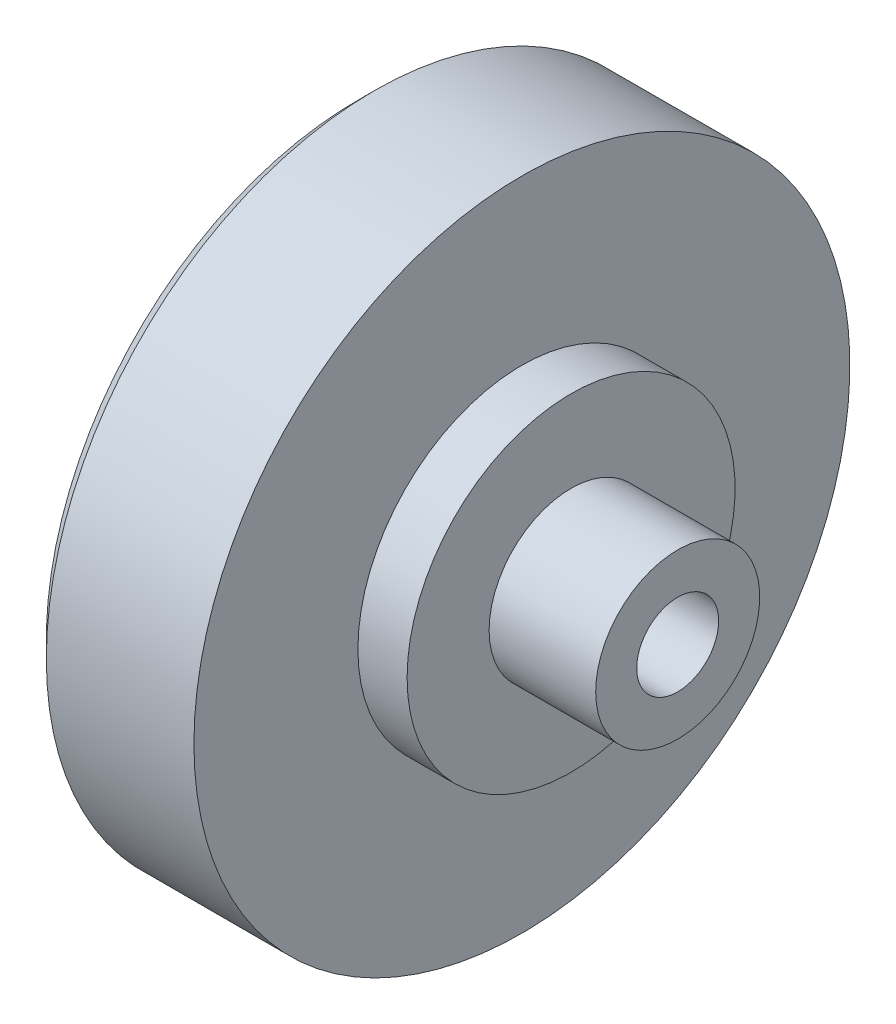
from build123d import *

# Parameters (mm, degrees)
CHAMFER1_SIZE      = 1
SKETCH2_R          = 2.5
CUT_EXTRUDE1_DEPTH = 15


with BuildPart() as part:
    # Sketch1 → Revolve1 (revolve)
    with BuildSketch(Plane(origin=(0, 0, 0), x_dir=(1, 0, 0), z_dir=(0, 1, 0)), mode=Mode.PRIVATE) as revolve1_sk:
        Polygon((0, 0), (19.5, 0), (19.5, 5), (13, 5), (13, 10), (10, 10), (10, 20), (0, 20), align=None)
    revolve(revolve1_sk.sketch.rotate(Axis((0, 0, 0), (1, 0, 0)), 180), axis=Axis((0, 0, 0), (1, 0, 0)))

    # Chamfer1
    chamfer1_edges = [part.edges().sort_by_distance(p)[0] for p in [
        (0, 0, -20),
    ]]
    chamfer(chamfer1_edges, length=CHAMFER1_SIZE)

    # Sketch2 → Cut-Extrude1 (cut)
    with BuildSketch(Plane(origin=(19.5, 0, 0), x_dir=(0, 0, -1), z_dir=(1, 0, 0))):
        Circle(SKETCH2_R)
    extrude(amount=-CUT_EXTRUDE1_DEPTH, mode=Mode.SUBTRACT)


solid = part.part
